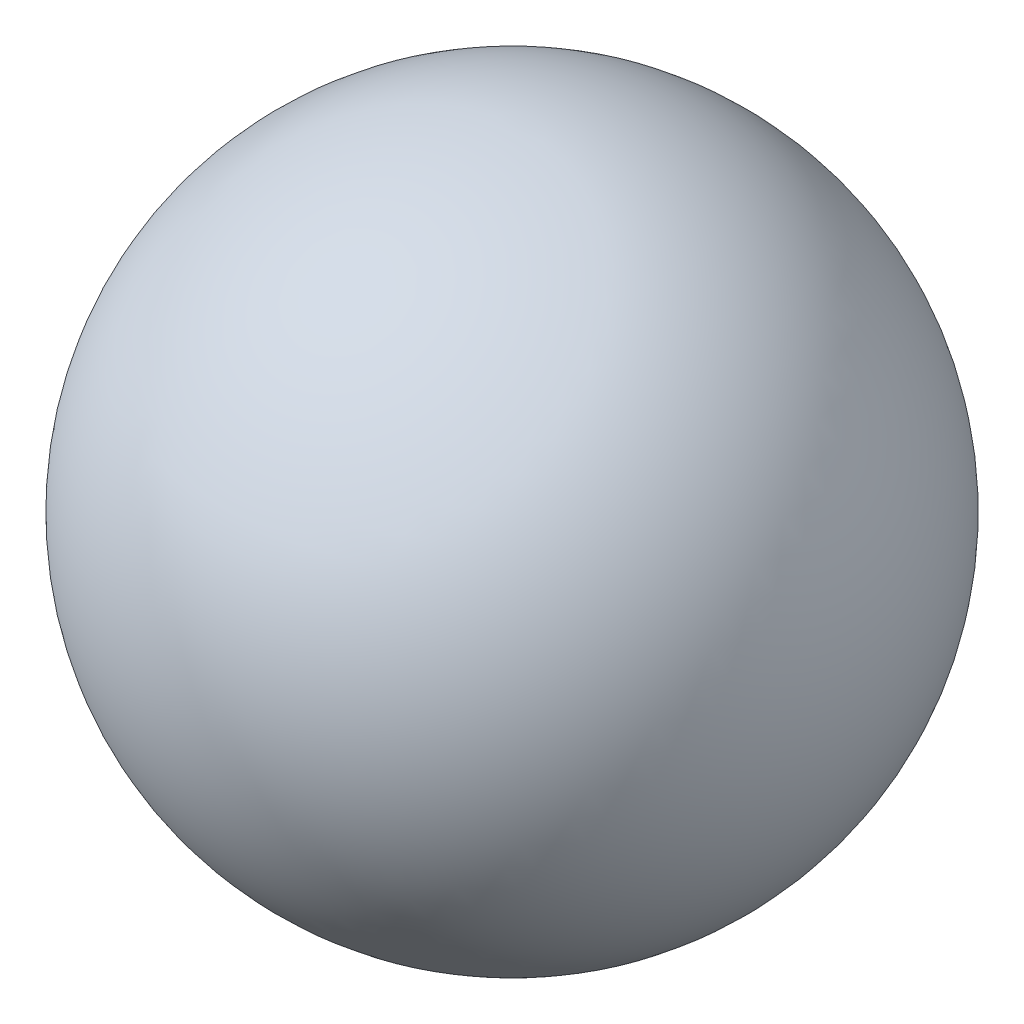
from build123d import *


with BuildPart() as part:
    # Esquisse1 → R_volution1 (revolve)
    with BuildSketch(Plane.XY):
        with BuildLine():
            Line((-6.041666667, 31.375), (-6.041666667, 22.125))
            ThreePointArc((-6.041666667, 22.125), (-10.666666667, 26.75), (-6.041666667, 31.375))
        make_face()
    revolve(axis=Axis((-6.041666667, 31.375, 0), (0, -1, 0)))


solid = part.part
